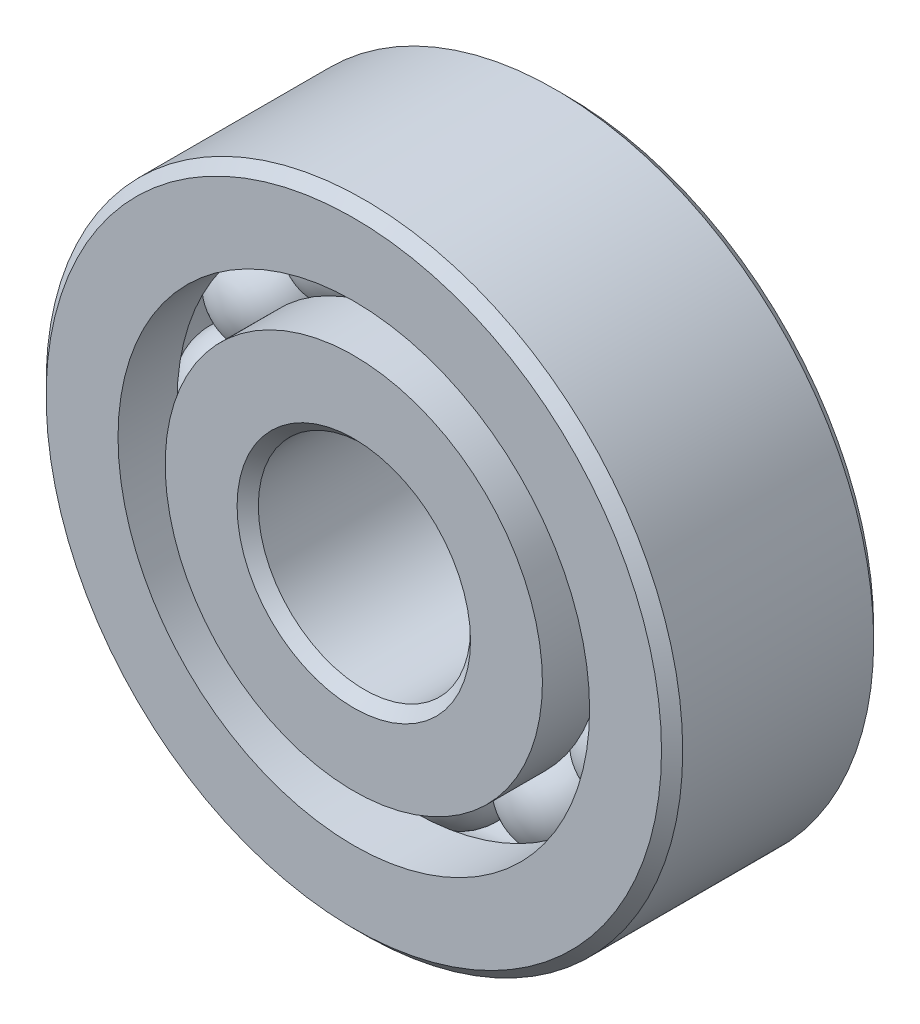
ISO-10303-21;
HEADER;
FILE_DESCRIPTION(('STEP AP214'),'2;1');
FILE_NAME('part.step','',(''),(''),'','','');
FILE_SCHEMA(('AUTOMOTIVE_DESIGN { 1 0 10303 214 1 1 1 1 }'));
ENDSEC;
DATA;
#1=APPLICATION_CONTEXT('core data for automotive mechanical design processes');
#2=APPLICATION_PROTOCOL_DEFINITION('international standard','automotive_design',2000,#1);
#3=PRODUCT_CONTEXT('',#1,'mechanical');
#4=PRODUCT('Part','Part','',(#3));
#5=PRODUCT_RELATED_PRODUCT_CATEGORY('part','',(#4));
#6=PRODUCT_DEFINITION_FORMATION('','',#4);
#7=PRODUCT_DEFINITION_CONTEXT('part definition',#1,'design');
#8=PRODUCT_DEFINITION('design','',#6,#7);
#9=PRODUCT_DEFINITION_SHAPE('','',#8);
#10=(LENGTH_UNIT() NAMED_UNIT(*) SI_UNIT(.MILLI.,.METRE.));
#11=(NAMED_UNIT(*) PLANE_ANGLE_UNIT() SI_UNIT($,.RADIAN.));
#12=(NAMED_UNIT(*) SI_UNIT($,.STERADIAN.) SOLID_ANGLE_UNIT());
#13=UNCERTAINTY_MEASURE_WITH_UNIT(LENGTH_MEASURE(1.E-05),#10,'distance_accuracy_value','');
#14=(GEOMETRIC_REPRESENTATION_CONTEXT(3) GLOBAL_UNCERTAINTY_ASSIGNED_CONTEXT((#13)) GLOBAL_UNIT_ASSIGNED_CONTEXT((#10,
#11,#12)) REPRESENTATION_CONTEXT('',''));
#15=CARTESIAN_POINT('',(0.,0.,0.));
#16=DIRECTION('',(0.,0.,1.));
#17=DIRECTION('',(1.,0.,0.));
#18=AXIS2_PLACEMENT_3D('',#15,#16,#17);
#19=CARTESIAN_POINT('',(-0.499999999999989,0.866025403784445,0.));
#20=DIRECTION('',(0.,0.,1.));
#21=DIRECTION('',(-0.499999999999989,0.866025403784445,0.));
#22=AXIS2_PLACEMENT_3D('',#19,#20,#21);
#23=SPHERICAL_SURFACE('',#22,0.248451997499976);
#24=CARTESIAN_POINT('',(-0.499999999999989,0.866025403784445,0.248451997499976));
#25=VERTEX_POINT('',#24);
#26=VERTEX_LOOP('',#25);
#27=FACE_BOUND('',#26,.T.);
#28=ADVANCED_FACE('F39',(#27),#23,.T.);
#29=CLOSED_SHELL('',(#28));
#30=MANIFOLD_SOLID_BREP('B2',#29);
#31=CARTESIAN_POINT('',(-0.866025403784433,0.50000000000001,0.));
#32=DIRECTION('',(0.,0.,1.));
#33=DIRECTION('',(-0.866025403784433,0.50000000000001,0.));
#34=AXIS2_PLACEMENT_3D('',#31,#32,#33);
#35=SPHERICAL_SURFACE('',#34,0.248451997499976);
#36=CARTESIAN_POINT('',(-0.866025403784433,0.50000000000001,0.248451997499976));
#37=VERTEX_POINT('',#36);
#38=VERTEX_LOOP('',#37);
#39=FACE_BOUND('',#38,.T.);
#40=ADVANCED_FACE('F70',(#39),#35,.T.);
#41=CLOSED_SHELL('',(#40));
#42=MANIFOLD_SOLID_BREP('B6',#41);
#43=CARTESIAN_POINT('',(-1.,0.,0.));
#44=DIRECTION('',(0.,0.,1.));
#45=DIRECTION('',(-1.,0.,0.));
#46=AXIS2_PLACEMENT_3D('',#43,#44,#45);
#47=SPHERICAL_SURFACE('',#46,0.248451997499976);
#48=CARTESIAN_POINT('',(-1.,0.,0.248451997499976));
#49=VERTEX_POINT('',#48);
#50=VERTEX_LOOP('',#49);
#51=FACE_BOUND('',#50,.T.);
#52=ADVANCED_FACE('F101',(#51),#47,.T.);
#53=CLOSED_SHELL('',(#52));
#54=MANIFOLD_SOLID_BREP('B35',#53);
#55=CARTESIAN_POINT('',(-0.866025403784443,-0.499999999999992,0.));
#56=DIRECTION('',(0.,0.,1.));
#57=DIRECTION('',(-0.866025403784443,-0.499999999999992,0.));
#58=AXIS2_PLACEMENT_3D('',#55,#56,#57);
#59=SPHERICAL_SURFACE('',#58,0.248451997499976);
#60=CARTESIAN_POINT('',(-0.866025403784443,-0.499999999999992,0.248451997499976));
#61=VERTEX_POINT('',#60);
#62=VERTEX_LOOP('',#61);
#63=FACE_BOUND('',#62,.T.);
#64=ADVANCED_FACE('F132',(#63),#59,.T.);
#65=CLOSED_SHELL('',(#64));
#66=MANIFOLD_SOLID_BREP('B66',#65);
#67=CARTESIAN_POINT('',(-0.500000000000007,-0.866025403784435,0.));
#68=DIRECTION('',(0.,0.,1.));
#69=DIRECTION('',(-0.500000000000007,-0.866025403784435,0.));
#70=AXIS2_PLACEMENT_3D('',#67,#68,#69);
#71=SPHERICAL_SURFACE('',#70,0.248451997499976);
#72=CARTESIAN_POINT('',(-0.500000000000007,-0.866025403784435,0.248451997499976));
#73=VERTEX_POINT('',#72);
#74=VERTEX_LOOP('',#73);
#75=FACE_BOUND('',#74,.T.);
#76=ADVANCED_FACE('F163',(#75),#71,.T.);
#77=CLOSED_SHELL('',(#76));
#78=MANIFOLD_SOLID_BREP('B97',#77);
#79=CARTESIAN_POINT('',(0.,-1.,0.));
#80=DIRECTION('',(0.,0.,1.));
#81=DIRECTION('',(0.,-1.,0.));
#82=AXIS2_PLACEMENT_3D('',#79,#80,#81);
#83=SPHERICAL_SURFACE('',#82,0.248451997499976);
#84=CARTESIAN_POINT('',(0.,-1.,0.248451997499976));
#85=VERTEX_POINT('',#84);
#86=VERTEX_LOOP('',#85);
#87=FACE_BOUND('',#86,.T.);
#88=ADVANCED_FACE('F194',(#87),#83,.T.);
#89=CLOSED_SHELL('',(#88));
#90=MANIFOLD_SOLID_BREP('B128',#89);
#91=CARTESIAN_POINT('',(0.499999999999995,-0.866025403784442,0.));
#92=DIRECTION('',(0.,0.,1.));
#93=DIRECTION('',(0.499999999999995,-0.866025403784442,0.));
#94=AXIS2_PLACEMENT_3D('',#91,#92,#93);
#95=SPHERICAL_SURFACE('',#94,0.248451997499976);
#96=CARTESIAN_POINT('',(0.499999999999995,-0.866025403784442,0.248451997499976));
#97=VERTEX_POINT('',#96);
#98=VERTEX_LOOP('',#97);
#99=FACE_BOUND('',#98,.T.);
#100=ADVANCED_FACE('F225',(#99),#95,.T.);
#101=CLOSED_SHELL('',(#100));
#102=MANIFOLD_SOLID_BREP('B159',#101);
#103=CARTESIAN_POINT('',(0.866025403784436,-0.500000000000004,0.));
#104=DIRECTION('',(0.,0.,1.));
#105=DIRECTION('',(0.866025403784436,-0.500000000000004,0.));
#106=AXIS2_PLACEMENT_3D('',#103,#104,#105);
#107=SPHERICAL_SURFACE('',#106,0.248451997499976);
#108=CARTESIAN_POINT('',(0.866025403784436,-0.500000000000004,0.248451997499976));
#109=VERTEX_POINT('',#108);
#110=VERTEX_LOOP('',#109);
#111=FACE_BOUND('',#110,.T.);
#112=ADVANCED_FACE('F256',(#111),#107,.T.);
#113=CLOSED_SHELL('',(#112));
#114=MANIFOLD_SOLID_BREP('B190',#113);
#115=CARTESIAN_POINT('',(1.,0.,0.));
#116=DIRECTION('',(0.,0.,1.));
#117=DIRECTION('',(1.,0.,0.));
#118=AXIS2_PLACEMENT_3D('',#115,#116,#117);
#119=SPHERICAL_SURFACE('',#118,0.248451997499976);
#120=CARTESIAN_POINT('',(1.,0.,0.248451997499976));
#121=VERTEX_POINT('',#120);
#122=VERTEX_LOOP('',#121);
#123=FACE_BOUND('',#122,.T.);
#124=ADVANCED_FACE('F287',(#123),#119,.T.);
#125=CLOSED_SHELL('',(#124));
#126=MANIFOLD_SOLID_BREP('B221',#125);
#127=CARTESIAN_POINT('',(0.86602540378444,0.499999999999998,0.));
#128=DIRECTION('',(0.,0.,1.));
#129=DIRECTION('',(0.86602540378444,0.499999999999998,0.));
#130=AXIS2_PLACEMENT_3D('',#127,#128,#129);
#131=SPHERICAL_SURFACE('',#130,0.248451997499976);
#132=CARTESIAN_POINT('',(0.86602540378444,0.499999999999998,0.248451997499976));
#133=VERTEX_POINT('',#132);
#134=VERTEX_LOOP('',#133);
#135=FACE_BOUND('',#134,.T.);
#136=ADVANCED_FACE('F318',(#135),#131,.T.);
#137=CLOSED_SHELL('',(#136));
#138=MANIFOLD_SOLID_BREP('B252',#137);
#139=CARTESIAN_POINT('',(0.500000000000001,0.866025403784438,0.));
#140=DIRECTION('',(0.,0.,1.));
#141=DIRECTION('',(0.500000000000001,0.866025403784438,0.));
#142=AXIS2_PLACEMENT_3D('',#139,#140,#141);
#143=SPHERICAL_SURFACE('',#142,0.248451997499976);
#144=CARTESIAN_POINT('',(0.500000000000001,0.866025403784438,0.248451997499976));
#145=VERTEX_POINT('',#144);
#146=VERTEX_LOOP('',#145);
#147=FACE_BOUND('',#146,.T.);
#148=ADVANCED_FACE('F349',(#147),#143,.T.);
#149=CLOSED_SHELL('',(#148));
#150=MANIFOLD_SOLID_BREP('B283',#149);
#151=CARTESIAN_POINT('',(0.,1.,0.));
#152=DIRECTION('',(0.,0.,1.));
#153=DIRECTION('',(0.,1.,0.));
#154=AXIS2_PLACEMENT_3D('',#151,#152,#153);
#155=SPHERICAL_SURFACE('',#154,0.248451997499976);
#156=CARTESIAN_POINT('',(0.,1.,0.248451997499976));
#157=VERTEX_POINT('',#156);
#158=VERTEX_LOOP('',#157);
#159=FACE_BOUND('',#158,.T.);
#160=ADVANCED_FACE('F382',(#159),#155,.T.);
#161=CLOSED_SHELL('',(#160));
#162=MANIFOLD_SOLID_BREP('B314',#161);
#163=CARTESIAN_POINT('',(0.,0.,0.45));
#164=DIRECTION('',(0.,0.,-1.));
#165=DIRECTION('',(-1.,0.,0.));
#166=AXIS2_PLACEMENT_3D('',#163,#164,#165);
#167=CONICAL_SURFACE('',#166,1.5,0.785398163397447);
#168=CARTESIAN_POINT('',(0.,0.,0.5));
#169=DIRECTION('',(0.,0.,1.));
#170=DIRECTION('',(1.,0.,0.));
#171=AXIS2_PLACEMENT_3D('',#168,#169,#170);
#172=CIRCLE('',#171,1.45);
#173=CARTESIAN_POINT('',(1.45,0.,0.5));
#174=VERTEX_POINT('',#173);
#175=EDGE_CURVE('E436',#174,#174,#172,.T.);
#176=ORIENTED_EDGE('',*,*,#175,.F.);
#177=EDGE_LOOP('',(#176));
#178=FACE_BOUND('',#177,.T.);
#179=CARTESIAN_POINT('',(0.,0.,0.45));
#180=DIRECTION('',(0.,0.,1.));
#181=DIRECTION('',(1.,0.,0.));
#182=AXIS2_PLACEMENT_3D('',#179,#180,#181);
#183=CIRCLE('',#182,1.5);
#184=CARTESIAN_POINT('',(1.5,0.,0.45));
#185=VERTEX_POINT('',#184);
#186=EDGE_CURVE('E381',#185,#185,#183,.T.);
#187=ORIENTED_EDGE('',*,*,#186,.T.);
#188=EDGE_LOOP('',(#187));
#189=FACE_BOUND('',#188,.T.);
#190=ADVANCED_FACE('F401',(#178,#189),#167,.T.);
#191=CARTESIAN_POINT('',(0.,0.,0.5));
#192=DIRECTION('',(0.,0.,1.));
#193=DIRECTION('',(1.,0.,0.));
#194=AXIS2_PLACEMENT_3D('',#191,#192,#193);
#195=CYLINDRICAL_SURFACE('',#194,1.5);
#196=ORIENTED_EDGE('',*,*,#186,.F.);
#197=EDGE_LOOP('',(#196));
#198=FACE_BOUND('',#197,.T.);
#199=CARTESIAN_POINT('',(0.,0.,-0.45));
#200=DIRECTION('',(0.,0.,1.));
#201=DIRECTION('',(1.,0.,0.));
#202=AXIS2_PLACEMENT_3D('',#199,#200,#201);
#203=CIRCLE('',#202,1.5);
#204=CARTESIAN_POINT('',(1.5,0.,-0.45));
#205=VERTEX_POINT('',#204);
#206=EDGE_CURVE('E408',#205,#205,#203,.T.);
#207=ORIENTED_EDGE('',*,*,#206,.T.);
#208=EDGE_LOOP('',(#207));
#209=FACE_BOUND('',#208,.T.);
#210=ADVANCED_FACE('F443',(#198,#209),#195,.T.);
#211=CARTESIAN_POINT('',(0.,0.,-0.5));
#212=DIRECTION('',(0.,0.,1.));
#213=DIRECTION('',(1.,0.,0.));
#214=AXIS2_PLACEMENT_3D('',#211,#212,#213);
#215=CONICAL_SURFACE('',#214,1.45,0.785398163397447);
#216=ORIENTED_EDGE('',*,*,#206,.F.);
#217=EDGE_LOOP('',(#216));
#218=FACE_BOUND('',#217,.T.);
#219=CARTESIAN_POINT('',(0.,0.,-0.5));
#220=DIRECTION('',(0.,0.,1.));
#221=DIRECTION('',(1.,0.,0.));
#222=AXIS2_PLACEMENT_3D('',#219,#220,#221);
#223=CIRCLE('',#222,1.45);
#224=CARTESIAN_POINT('',(1.45,0.,-0.5));
#225=VERTEX_POINT('',#224);
#226=EDGE_CURVE('E415',#225,#225,#223,.T.);
#227=ORIENTED_EDGE('',*,*,#226,.T.);
#228=EDGE_LOOP('',(#227));
#229=FACE_BOUND('',#228,.T.);
#230=ADVANCED_FACE('F447',(#218,#229),#215,.T.);
#231=CARTESIAN_POINT('',(0.,1.45,-0.500000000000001));
#232=DIRECTION('',(0.,0.,1.));
#233=DIRECTION('',(1.,0.,0.));
#234=AXIS2_PLACEMENT_3D('',#231,#232,#233);
#235=PLANE('',#234);
#236=ORIENTED_EDGE('',*,*,#226,.F.);
#237=EDGE_LOOP('',(#236));
#238=FACE_BOUND('',#237,.T.);
#239=CARTESIAN_POINT('',(0.,0.,-0.500000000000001));
#240=DIRECTION('',(0.,0.,1.));
#241=DIRECTION('',(1.,0.,0.));
#242=AXIS2_PLACEMENT_3D('',#239,#240,#241);
#243=CIRCLE('',#242,1.11111111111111);
#244=CARTESIAN_POINT('',(1.11111111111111,0.,-0.500000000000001));
#245=VERTEX_POINT('',#244);
#246=EDGE_CURVE('E420',#245,#245,#243,.T.);
#247=ORIENTED_EDGE('',*,*,#246,.T.);
#248=EDGE_LOOP('',(#247));
#249=FACE_BOUND('',#248,.T.);
#250=ADVANCED_FACE('F452',(#238,#249),#235,.F.);
#251=CARTESIAN_POINT('',(0.,0.,0.5));
#252=DIRECTION('',(0.,0.,1.));
#253=DIRECTION('',(1.,0.,0.));
#254=AXIS2_PLACEMENT_3D('',#251,#252,#253);
#255=CYLINDRICAL_SURFACE('',#254,1.11111111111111);
#256=ORIENTED_EDGE('',*,*,#246,.F.);
#257=EDGE_LOOP('',(#256));
#258=FACE_BOUND('',#257,.T.);
#259=CARTESIAN_POINT('',(0.,0.,-0.222222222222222));
#260=DIRECTION('',(0.,0.,1.));
#261=DIRECTION('',(1.,0.,0.));
#262=AXIS2_PLACEMENT_3D('',#259,#260,#261);
#263=CIRCLE('',#262,1.11111111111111);
#264=CARTESIAN_POINT('',(1.11111111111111,0.,-0.222222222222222));
#265=VERTEX_POINT('',#264);
#266=EDGE_CURVE('E426',#265,#265,#263,.T.);
#267=ORIENTED_EDGE('',*,*,#266,.T.);
#268=EDGE_LOOP('',(#267));
#269=FACE_BOUND('',#268,.T.);
#270=ADVANCED_FACE('F458',(#258,#269),#255,.F.);
#271=CARTESIAN_POINT('',(0.,0.,0.));
#272=DIRECTION('',(0.,0.,1.));
#273=DIRECTION('',(1.,0.,0.));
#274=AXIS2_PLACEMENT_3D('',#271,#272,#273);
#275=TOROIDAL_SURFACE('',#274,1.00000000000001,0.248451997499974);
#276=ORIENTED_EDGE('',*,*,#266,.F.);
#277=EDGE_LOOP('',(#276));
#278=FACE_BOUND('',#277,.T.);
#279=CARTESIAN_POINT('',(0.,0.,0.222222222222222));
#280=DIRECTION('',(0.,0.,1.));
#281=DIRECTION('',(1.,0.,0.));
#282=AXIS2_PLACEMENT_3D('',#279,#280,#281);
#283=CIRCLE('',#282,1.11111111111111);
#284=CARTESIAN_POINT('',(1.11111111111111,0.,0.222222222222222));
#285=VERTEX_POINT('',#284);
#286=EDGE_CURVE('E430',#285,#285,#283,.T.);
#287=ORIENTED_EDGE('',*,*,#286,.T.);
#288=EDGE_LOOP('',(#287));
#289=FACE_BOUND('',#288,.T.);
#290=ADVANCED_FACE('F462',(#278,#289),#275,.F.);
#291=CARTESIAN_POINT('',(0.,0.,0.5));
#292=DIRECTION('',(0.,0.,1.));
#293=DIRECTION('',(1.,0.,0.));
#294=AXIS2_PLACEMENT_3D('',#291,#292,#293);
#295=CYLINDRICAL_SURFACE('',#294,1.11111111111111);
#296=ORIENTED_EDGE('',*,*,#286,.F.);
#297=EDGE_LOOP('',(#296));
#298=FACE_BOUND('',#297,.T.);
#299=CARTESIAN_POINT('',(0.,0.,0.5));
#300=DIRECTION('',(0.,0.,1.));
#301=DIRECTION('',(1.,0.,0.));
#302=AXIS2_PLACEMENT_3D('',#299,#300,#301);
#303=CIRCLE('',#302,1.11111111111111);
#304=CARTESIAN_POINT('',(1.11111111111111,0.,0.5));
#305=VERTEX_POINT('',#304);
#306=EDGE_CURVE('E433',#305,#305,#303,.T.);
#307=ORIENTED_EDGE('',*,*,#306,.T.);
#308=EDGE_LOOP('',(#307));
#309=FACE_BOUND('',#308,.T.);
#310=ADVANCED_FACE('F466',(#298,#309),#295,.F.);
#311=CARTESIAN_POINT('',(0.,1.45,0.5));
#312=DIRECTION('',(0.,0.,-1.));
#313=DIRECTION('',(-1.,0.,0.));
#314=AXIS2_PLACEMENT_3D('',#311,#312,#313);
#315=PLANE('',#314);
#316=ORIENTED_EDGE('',*,*,#306,.F.);
#317=EDGE_LOOP('',(#316));
#318=FACE_BOUND('',#317,.T.);
#319=ORIENTED_EDGE('',*,*,#175,.T.);
#320=EDGE_LOOP('',(#319));
#321=FACE_BOUND('',#320,.T.);
#322=ADVANCED_FACE('F440',(#318,#321),#315,.F.);
#323=CLOSED_SHELL('',(#190,#210,#230,#250,#270,#290,#310,#322));
#324=MANIFOLD_SOLID_BREP('B345',#323);
#325=CARTESIAN_POINT('',(0.,0.888888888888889,0.5));
#326=DIRECTION('',(0.,0.,-1.));
#327=DIRECTION('',(-1.,0.,0.));
#328=AXIS2_PLACEMENT_3D('',#325,#326,#327);
#329=PLANE('',#328);
#330=CARTESIAN_POINT('',(0.,0.,0.5));
#331=DIRECTION('',(0.,0.,1.));
#332=DIRECTION('',(1.,0.,0.));
#333=AXIS2_PLACEMENT_3D('',#330,#331,#332);
#334=CIRCLE('',#333,0.55);
#335=CARTESIAN_POINT('',(0.55,0.,0.5));
#336=VERTEX_POINT('',#335);
#337=EDGE_CURVE('E400',#336,#336,#334,.T.);
#338=ORIENTED_EDGE('',*,*,#337,.F.);
#339=EDGE_LOOP('',(#338));
#340=FACE_BOUND('',#339,.T.);
#341=CARTESIAN_POINT('',(0.,0.,0.5));
#342=DIRECTION('',(0.,0.,1.));
#343=DIRECTION('',(1.,0.,0.));
#344=AXIS2_PLACEMENT_3D('',#341,#342,#343);
#345=CIRCLE('',#344,0.888888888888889);
#346=CARTESIAN_POINT('',(0.888888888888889,0.,0.5));
#347=VERTEX_POINT('',#346);
#348=EDGE_CURVE('E557',#347,#347,#345,.T.);
#349=ORIENTED_EDGE('',*,*,#348,.T.);
#350=EDGE_LOOP('',(#349));
#351=FACE_BOUND('',#350,.T.);
#352=ADVANCED_FACE('F529',(#340,#351),#329,.F.);
#353=CARTESIAN_POINT('',(0.,0.,0.5));
#354=DIRECTION('',(0.,0.,1.));
#355=DIRECTION('',(1.,0.,0.));
#356=AXIS2_PLACEMENT_3D('',#353,#354,#355);
#357=CONICAL_SURFACE('',#356,0.55,0.785398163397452);
#358=CARTESIAN_POINT('',(0.,0.,0.45));
#359=DIRECTION('',(0.,0.,1.));
#360=DIRECTION('',(1.,0.,0.));
#361=AXIS2_PLACEMENT_3D('',#358,#359,#360);
#362=CIRCLE('',#361,0.5);
#363=CARTESIAN_POINT('',(0.5,0.,0.45));
#364=VERTEX_POINT('',#363);
#365=EDGE_CURVE('E535',#364,#364,#362,.T.);
#366=ORIENTED_EDGE('',*,*,#365,.F.);
#367=EDGE_LOOP('',(#366));
#368=FACE_BOUND('',#367,.T.);
#369=ORIENTED_EDGE('',*,*,#337,.T.);
#370=EDGE_LOOP('',(#369));
#371=FACE_BOUND('',#370,.T.);
#372=ADVANCED_FACE('F594',(#368,#371),#357,.F.);
#373=CARTESIAN_POINT('',(0.,0.,0.5));
#374=DIRECTION('',(0.,0.,1.));
#375=DIRECTION('',(1.,0.,0.));
#376=AXIS2_PLACEMENT_3D('',#373,#374,#375);
#377=CYLINDRICAL_SURFACE('',#376,0.5);
#378=CARTESIAN_POINT('',(0.,0.,-0.45));
#379=DIRECTION('',(0.,0.,1.));
#380=DIRECTION('',(1.,0.,0.));
#381=AXIS2_PLACEMENT_3D('',#378,#379,#380);
#382=CIRCLE('',#381,0.5);
#383=CARTESIAN_POINT('',(0.5,0.,-0.45));
#384=VERTEX_POINT('',#383);
#385=EDGE_CURVE('E539',#384,#384,#382,.T.);
#386=ORIENTED_EDGE('',*,*,#385,.F.);
#387=EDGE_LOOP('',(#386));
#388=FACE_BOUND('',#387,.T.);
#389=ORIENTED_EDGE('',*,*,#365,.T.);
#390=EDGE_LOOP('',(#389));
#391=FACE_BOUND('',#390,.T.);
#392=ADVANCED_FACE('F589',(#388,#391),#377,.F.);
#393=CARTESIAN_POINT('',(0.,0.,-0.45));
#394=DIRECTION('',(0.,0.,-1.));
#395=DIRECTION('',(-1.,0.,0.));
#396=AXIS2_PLACEMENT_3D('',#393,#394,#395);
#397=CONICAL_SURFACE('',#396,0.5,0.785398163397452);
#398=CARTESIAN_POINT('',(0.,0.,-0.5));
#399=DIRECTION('',(0.,0.,1.));
#400=DIRECTION('',(1.,0.,0.));
#401=AXIS2_PLACEMENT_3D('',#398,#399,#400);
#402=CIRCLE('',#401,0.55);
#403=CARTESIAN_POINT('',(0.55,0.,-0.5));
#404=VERTEX_POINT('',#403);
#405=EDGE_CURVE('E543',#404,#404,#402,.T.);
#406=ORIENTED_EDGE('',*,*,#405,.F.);
#407=EDGE_LOOP('',(#406));
#408=FACE_BOUND('',#407,.T.);
#409=ORIENTED_EDGE('',*,*,#385,.T.);
#410=EDGE_LOOP('',(#409));
#411=FACE_BOUND('',#410,.T.);
#412=ADVANCED_FACE('F583',(#408,#411),#397,.F.);
#413=CARTESIAN_POINT('',(0.,0.888888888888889,-0.5));
#414=DIRECTION('',(0.,0.,1.));
#415=DIRECTION('',(1.,0.,0.));
#416=AXIS2_PLACEMENT_3D('',#413,#414,#415);
#417=PLANE('',#416);
#418=CARTESIAN_POINT('',(0.,0.,-0.5));
#419=DIRECTION('',(0.,0.,1.));
#420=DIRECTION('',(1.,0.,0.));
#421=AXIS2_PLACEMENT_3D('',#418,#419,#420);
#422=CIRCLE('',#421,0.888888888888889);
#423=CARTESIAN_POINT('',(0.888888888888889,0.,-0.5));
#424=VERTEX_POINT('',#423);
#425=EDGE_CURVE('E548',#424,#424,#422,.T.);
#426=ORIENTED_EDGE('',*,*,#425,.F.);
#427=EDGE_LOOP('',(#426));
#428=FACE_BOUND('',#427,.T.);
#429=ORIENTED_EDGE('',*,*,#405,.T.);
#430=EDGE_LOOP('',(#429));
#431=FACE_BOUND('',#430,.T.);
#432=ADVANCED_FACE('F577',(#428,#431),#417,.F.);
#433=CARTESIAN_POINT('',(0.,0.,0.5));
#434=DIRECTION('',(0.,0.,1.));
#435=DIRECTION('',(1.,0.,0.));
#436=AXIS2_PLACEMENT_3D('',#433,#434,#435);
#437=CYLINDRICAL_SURFACE('',#436,0.888888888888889);
#438=CARTESIAN_POINT('',(0.,0.,-0.222222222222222));
#439=DIRECTION('',(0.,0.,1.));
#440=DIRECTION('',(1.,0.,0.));
#441=AXIS2_PLACEMENT_3D('',#438,#439,#440);
#442=CIRCLE('',#441,0.888888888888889);
#443=CARTESIAN_POINT('',(0.888888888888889,0.,-0.222222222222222));
#444=VERTEX_POINT('',#443);
#445=EDGE_CURVE('E551',#444,#444,#442,.T.);
#446=ORIENTED_EDGE('',*,*,#445,.F.);
#447=EDGE_LOOP('',(#446));
#448=FACE_BOUND('',#447,.T.);
#449=ORIENTED_EDGE('',*,*,#425,.T.);
#450=EDGE_LOOP('',(#449));
#451=FACE_BOUND('',#450,.T.);
#452=ADVANCED_FACE('F571',(#448,#451),#437,.T.);
#453=CARTESIAN_POINT('',(0.,0.,0.));
#454=DIRECTION('',(0.,0.,1.));
#455=DIRECTION('',(1.,0.,0.));
#456=AXIS2_PLACEMENT_3D('',#453,#454,#455);
#457=TOROIDAL_SURFACE('',#456,1.,0.248451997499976);
#458=CARTESIAN_POINT('',(0.,0.,0.222222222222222));
#459=DIRECTION('',(0.,0.,1.));
#460=DIRECTION('',(1.,0.,0.));
#461=AXIS2_PLACEMENT_3D('',#458,#459,#460);
#462=CIRCLE('',#461,0.888888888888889);
#463=CARTESIAN_POINT('',(0.888888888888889,0.,0.222222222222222));
#464=VERTEX_POINT('',#463);
#465=EDGE_CURVE('E554',#464,#464,#462,.T.);
#466=ORIENTED_EDGE('',*,*,#465,.F.);
#467=EDGE_LOOP('',(#466));
#468=FACE_BOUND('',#467,.T.);
#469=ORIENTED_EDGE('',*,*,#445,.T.);
#470=EDGE_LOOP('',(#469));
#471=FACE_BOUND('',#470,.T.);
#472=ADVANCED_FACE('F565',(#468,#471),#457,.F.);
#473=CARTESIAN_POINT('',(0.,0.,0.5));
#474=DIRECTION('',(0.,0.,1.));
#475=DIRECTION('',(1.,0.,0.));
#476=AXIS2_PLACEMENT_3D('',#473,#474,#475);
#477=CYLINDRICAL_SURFACE('',#476,0.888888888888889);
#478=ORIENTED_EDGE('',*,*,#348,.F.);
#479=EDGE_LOOP('',(#478));
#480=FACE_BOUND('',#479,.T.);
#481=ORIENTED_EDGE('',*,*,#465,.T.);
#482=EDGE_LOOP('',(#481));
#483=FACE_BOUND('',#482,.T.);
#484=ADVANCED_FACE('F562',(#480,#483),#477,.T.);
#485=CLOSED_SHELL('',(#352,#372,#392,#412,#432,#452,#472,#484));
#486=MANIFOLD_SOLID_BREP('B376',#485);
#487=ADVANCED_BREP_SHAPE_REPRESENTATION('',(#18,#30,#42,#54,#66,#78,#90,#102,#114,#126,#138,
#150,#162,#324,#486),#14);
#488=SHAPE_DEFINITION_REPRESENTATION(#9,#487);
ENDSEC;
END-ISO-10303-21;
